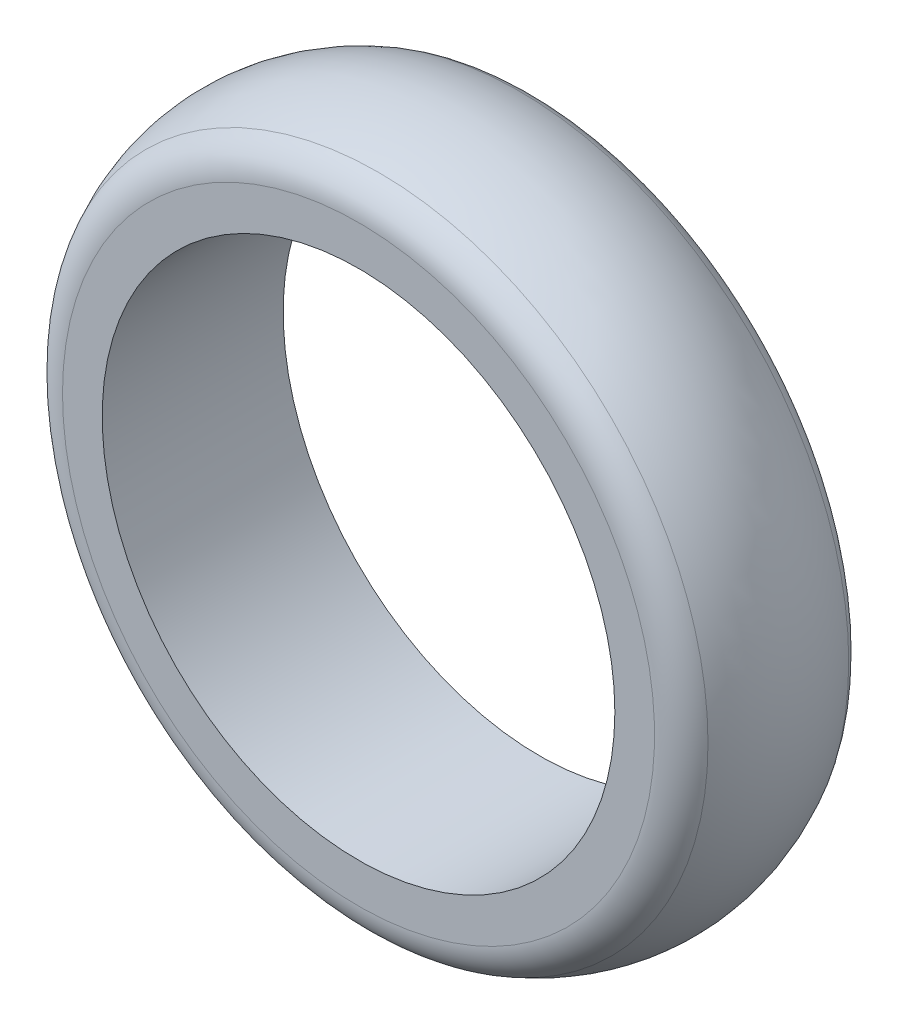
ISO-10303-21;
HEADER;
FILE_DESCRIPTION(('STEP AP214'),'2;1');
FILE_NAME('part.step','',(''),(''),'','','');
FILE_SCHEMA(('AUTOMOTIVE_DESIGN { 1 0 10303 214 1 1 1 1 }'));
ENDSEC;
DATA;
#1=APPLICATION_CONTEXT('core data for automotive mechanical design processes');
#2=APPLICATION_PROTOCOL_DEFINITION('international standard','automotive_design',2000,#1);
#3=PRODUCT_CONTEXT('',#1,'mechanical');
#4=PRODUCT('Part','Part','',(#3));
#5=PRODUCT_RELATED_PRODUCT_CATEGORY('part','',(#4));
#6=PRODUCT_DEFINITION_FORMATION('','',#4);
#7=PRODUCT_DEFINITION_CONTEXT('part definition',#1,'design');
#8=PRODUCT_DEFINITION('design','',#6,#7);
#9=PRODUCT_DEFINITION_SHAPE('','',#8);
#10=(LENGTH_UNIT() NAMED_UNIT(*) SI_UNIT(.MILLI.,.METRE.));
#11=(NAMED_UNIT(*) PLANE_ANGLE_UNIT() SI_UNIT($,.RADIAN.));
#12=(NAMED_UNIT(*) SI_UNIT($,.STERADIAN.) SOLID_ANGLE_UNIT());
#13=UNCERTAINTY_MEASURE_WITH_UNIT(LENGTH_MEASURE(1.E-05),#10,'distance_accuracy_value','');
#14=(GEOMETRIC_REPRESENTATION_CONTEXT(3) GLOBAL_UNCERTAINTY_ASSIGNED_CONTEXT((#13)) GLOBAL_UNIT_ASSIGNED_CONTEXT((#10,
#11,#12)) REPRESENTATION_CONTEXT('',''));
#15=CARTESIAN_POINT('',(0.,0.,0.));
#16=DIRECTION('',(0.,0.,1.));
#17=DIRECTION('',(1.,0.,0.));
#18=AXIS2_PLACEMENT_3D('',#15,#16,#17);
#19=CARTESIAN_POINT('',(0.,34.,0.));
#20=DIRECTION('',(0.,0.,-1.));
#21=DIRECTION('',(-1.,0.,0.));
#22=AXIS2_PLACEMENT_3D('',#19,#20,#21);
#23=PLANE('',#22);
#24=CARTESIAN_POINT('',(0.,0.,0.));
#25=DIRECTION('',(0.,0.,-1.));
#26=DIRECTION('',(-1.,0.,0.));
#27=AXIS2_PLACEMENT_3D('',#24,#25,#26);
#28=CIRCLE('',#27,39.2664991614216);
#29=CARTESIAN_POINT('',(-39.2664991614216,0.,0.));
#30=VERTEX_POINT('',#29);
#31=EDGE_CURVE('E10',#30,#30,#28,.F.);
#32=ORIENTED_EDGE('',*,*,#31,.T.);
#33=EDGE_LOOP('',(#32));
#34=FACE_BOUND('',#33,.T.);
#35=CARTESIAN_POINT('',(0.,0.,0.));
#36=DIRECTION('',(0.,0.,1.));
#37=DIRECTION('',(1.,0.,0.));
#38=AXIS2_PLACEMENT_3D('',#35,#36,#37);
#39=CIRCLE('',#38,34.);
#40=CARTESIAN_POINT('',(34.,0.,0.));
#41=VERTEX_POINT('',#40);
#42=EDGE_CURVE('E55',#41,#41,#39,.T.);
#43=ORIENTED_EDGE('',*,*,#42,.F.);
#44=EDGE_LOOP('',(#43));
#45=FACE_BOUND('',#44,.T.);
#46=ADVANCED_FACE('F32',(#34,#45),#23,.F.);
#47=CARTESIAN_POINT('',(0.,0.,-12.));
#48=DIRECTION('',(0.,0.,1.));
#49=DIRECTION('',(1.,0.,0.));
#50=AXIS2_PLACEMENT_3D('',#47,#48,#49);
#51=TOROIDAL_SURFACE('',#50,26.,20.);
#52=CARTESIAN_POINT('',(0.,0.,-21.3333333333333));
#53=DIRECTION('',(0.,0.,1.));
#54=DIRECTION('',(1.,0.,0.));
#55=AXIS2_PLACEMENT_3D('',#52,#53,#54);
#56=CIRCLE('',#55,43.6886655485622);
#57=CARTESIAN_POINT('',(43.6886655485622,0.,-21.3333333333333));
#58=VERTEX_POINT('',#57);
#59=EDGE_CURVE('E43',#58,#58,#56,.T.);
#60=ORIENTED_EDGE('',*,*,#59,.T.);
#61=EDGE_LOOP('',(#60));
#62=FACE_BOUND('',#61,.T.);
#63=CARTESIAN_POINT('',(0.,0.,-2.66666666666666));
#64=DIRECTION('',(0.,0.,-1.));
#65=DIRECTION('',(-1.,0.,0.));
#66=AXIS2_PLACEMENT_3D('',#63,#64,#65);
#67=CIRCLE('',#66,43.6886655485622);
#68=CARTESIAN_POINT('',(-43.6886655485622,0.,-2.66666666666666));
#69=VERTEX_POINT('',#68);
#70=EDGE_CURVE('E47',#69,#69,#67,.T.);
#71=ORIENTED_EDGE('',*,*,#70,.T.);
#72=EDGE_LOOP('',(#71));
#73=FACE_BOUND('',#72,.T.);
#74=ADVANCED_FACE('F62',(#62,#73),#51,.T.);
#75=CARTESIAN_POINT('',(0.,34.,-24.));
#76=DIRECTION('',(0.,0.,1.));
#77=DIRECTION('',(1.,0.,0.));
#78=AXIS2_PLACEMENT_3D('',#75,#76,#77);
#79=PLANE('',#78);
#80=CARTESIAN_POINT('',(0.,0.,-24.));
#81=DIRECTION('',(0.,0.,1.));
#82=DIRECTION('',(1.,0.,0.));
#83=AXIS2_PLACEMENT_3D('',#80,#81,#82);
#84=CIRCLE('',#83,39.2664991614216);
#85=CARTESIAN_POINT('',(39.2664991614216,0.,-24.));
#86=VERTEX_POINT('',#85);
#87=EDGE_CURVE('E39',#86,#86,#84,.F.);
#88=ORIENTED_EDGE('',*,*,#87,.T.);
#89=EDGE_LOOP('',(#88));
#90=FACE_BOUND('',#89,.T.);
#91=CARTESIAN_POINT('',(0.,0.,-24.));
#92=DIRECTION('',(0.,0.,1.));
#93=DIRECTION('',(1.,0.,0.));
#94=AXIS2_PLACEMENT_3D('',#91,#92,#93);
#95=CIRCLE('',#94,34.);
#96=CARTESIAN_POINT('',(34.,0.,-24.));
#97=VERTEX_POINT('',#96);
#98=EDGE_CURVE('E52',#97,#97,#95,.T.);
#99=ORIENTED_EDGE('',*,*,#98,.T.);
#100=EDGE_LOOP('',(#99));
#101=FACE_BOUND('',#100,.T.);
#102=ADVANCED_FACE('F67',(#90,#101),#79,.F.);
#103=CARTESIAN_POINT('',(0.,0.,0.));
#104=DIRECTION('',(0.,0.,1.));
#105=DIRECTION('',(1.,0.,0.));
#106=AXIS2_PLACEMENT_3D('',#103,#104,#105);
#107=CYLINDRICAL_SURFACE('',#106,34.);
#108=ORIENTED_EDGE('',*,*,#98,.F.);
#109=EDGE_LOOP('',(#108));
#110=FACE_BOUND('',#109,.T.);
#111=ORIENTED_EDGE('',*,*,#42,.T.);
#112=EDGE_LOOP('',(#111));
#113=FACE_BOUND('',#112,.T.);
#114=ADVANCED_FACE('F59',(#110,#113),#107,.F.);
#115=CARTESIAN_POINT('',(0.,0.,-19.));
#116=DIRECTION('',(0.,0.,1.));
#117=DIRECTION('',(1.,0.,0.));
#118=AXIS2_PLACEMENT_3D('',#115,#116,#117);
#119=TOROIDAL_SURFACE('',#118,39.2664991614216,5.);
#120=ORIENTED_EDGE('',*,*,#87,.F.);
#121=EDGE_LOOP('',(#120));
#122=FACE_BOUND('',#121,.T.);
#123=ORIENTED_EDGE('',*,*,#59,.F.);
#124=EDGE_LOOP('',(#123));
#125=FACE_BOUND('',#124,.T.);
#126=ADVANCED_FACE('F71',(#122,#125),#119,.T.);
#127=CARTESIAN_POINT('',(0.,0.,-5.));
#128=DIRECTION('',(0.,0.,-1.));
#129=DIRECTION('',(-1.,0.,0.));
#130=AXIS2_PLACEMENT_3D('',#127,#128,#129);
#131=TOROIDAL_SURFACE('',#130,39.2664991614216,5.);
#132=ORIENTED_EDGE('',*,*,#70,.F.);
#133=EDGE_LOOP('',(#132));
#134=FACE_BOUND('',#133,.T.);
#135=ORIENTED_EDGE('',*,*,#31,.F.);
#136=EDGE_LOOP('',(#135));
#137=FACE_BOUND('',#136,.T.);
#138=ADVANCED_FACE('F34',(#134,#137),#131,.T.);
#139=CLOSED_SHELL('',(#46,#74,#102,#114,#126,#138));
#140=MANIFOLD_SOLID_BREP('B2',#139);
#141=ADVANCED_BREP_SHAPE_REPRESENTATION('',(#18,#140),#14);
#142=SHAPE_DEFINITION_REPRESENTATION(#9,#141);
ENDSEC;
END-ISO-10303-21;
